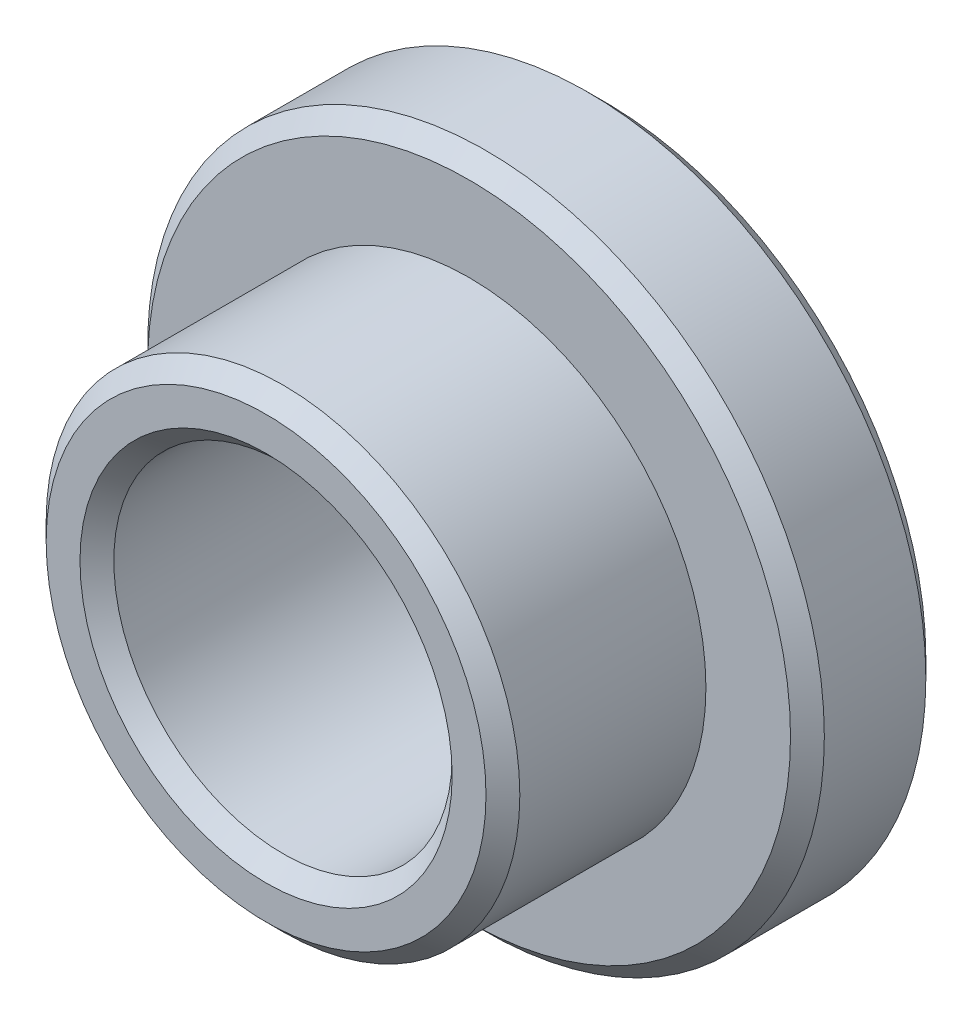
ISO-10303-21;
HEADER;
FILE_DESCRIPTION(('STEP AP214'),'2;1');
FILE_NAME('part.step','',(''),(''),'','','');
FILE_SCHEMA(('AUTOMOTIVE_DESIGN { 1 0 10303 214 1 1 1 1 }'));
ENDSEC;
DATA;
#1=APPLICATION_CONTEXT('core data for automotive mechanical design processes');
#2=APPLICATION_PROTOCOL_DEFINITION('international standard','automotive_design',2000,#1);
#3=PRODUCT_CONTEXT('',#1,'mechanical');
#4=PRODUCT('Part','Part','',(#3));
#5=PRODUCT_RELATED_PRODUCT_CATEGORY('part','',(#4));
#6=PRODUCT_DEFINITION_FORMATION('','',#4);
#7=PRODUCT_DEFINITION_CONTEXT('part definition',#1,'design');
#8=PRODUCT_DEFINITION('design','',#6,#7);
#9=PRODUCT_DEFINITION_SHAPE('','',#8);
#10=(LENGTH_UNIT() NAMED_UNIT(*) SI_UNIT(.MILLI.,.METRE.));
#11=(NAMED_UNIT(*) PLANE_ANGLE_UNIT() SI_UNIT($,.RADIAN.));
#12=(NAMED_UNIT(*) SI_UNIT($,.STERADIAN.) SOLID_ANGLE_UNIT());
#13=UNCERTAINTY_MEASURE_WITH_UNIT(LENGTH_MEASURE(1.E-05),#10,'distance_accuracy_value','');
#14=(GEOMETRIC_REPRESENTATION_CONTEXT(3) GLOBAL_UNCERTAINTY_ASSIGNED_CONTEXT((#13)) GLOBAL_UNIT_ASSIGNED_CONTEXT((#10,
#11,#12)) REPRESENTATION_CONTEXT('',''));
#15=CARTESIAN_POINT('',(0.,0.,0.));
#16=DIRECTION('',(0.,0.,1.));
#17=DIRECTION('',(1.,0.,0.));
#18=AXIS2_PLACEMENT_3D('',#15,#16,#17);
#19=CARTESIAN_POINT('',(0.,0.,2.));
#20=DIRECTION('',(0.,0.,-1.));
#21=DIRECTION('',(-1.,0.,0.));
#22=AXIS2_PLACEMENT_3D('',#19,#20,#21);
#23=CYLINDRICAL_SURFACE('',#22,5.);
#24=CARTESIAN_POINT('',(0.,0.,0.250000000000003));
#25=DIRECTION('',(0.,0.,1.));
#26=DIRECTION('',(1.,0.,0.));
#27=AXIS2_PLACEMENT_3D('',#24,#25,#26);
#28=CIRCLE('',#27,5.);
#29=CARTESIAN_POINT('',(5.,0.,0.250000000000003));
#30=VERTEX_POINT('',#29);
#31=EDGE_CURVE('E50',#30,#30,#28,.T.);
#32=ORIENTED_EDGE('',*,*,#31,.T.);
#33=EDGE_LOOP('',(#32));
#34=FACE_BOUND('',#33,.T.);
#35=CARTESIAN_POINT('',(0.,0.,1.75));
#36=DIRECTION('',(0.,0.,1.));
#37=DIRECTION('',(1.,0.,0.));
#38=AXIS2_PLACEMENT_3D('',#35,#36,#37);
#39=CIRCLE('',#38,5.);
#40=CARTESIAN_POINT('',(5.,0.,1.75));
#41=VERTEX_POINT('',#40);
#42=EDGE_CURVE('E53',#41,#41,#39,.F.);
#43=ORIENTED_EDGE('',*,*,#42,.T.);
#44=EDGE_LOOP('',(#43));
#45=FACE_BOUND('',#44,.T.);
#46=ADVANCED_FACE('F30',(#34,#45),#23,.T.);
#47=CARTESIAN_POINT('',(0.,0.,2.));
#48=DIRECTION('',(0.,0.,1.));
#49=DIRECTION('',(1.,0.,0.));
#50=AXIS2_PLACEMENT_3D('',#47,#48,#49);
#51=PLANE('',#50);
#52=CARTESIAN_POINT('',(0.,0.,2.));
#53=DIRECTION('',(0.,0.,1.));
#54=DIRECTION('',(1.,0.,0.));
#55=AXIS2_PLACEMENT_3D('',#52,#53,#54);
#56=CIRCLE('',#55,4.75);
#57=CARTESIAN_POINT('',(4.75,0.,2.));
#58=VERTEX_POINT('',#57);
#59=EDGE_CURVE('E45',#58,#58,#56,.T.);
#60=ORIENTED_EDGE('',*,*,#59,.T.);
#61=EDGE_LOOP('',(#60));
#62=FACE_BOUND('',#61,.T.);
#63=CARTESIAN_POINT('',(0.,0.,2.));
#64=DIRECTION('',(0.,0.,1.));
#65=DIRECTION('',(1.,0.,0.));
#66=AXIS2_PLACEMENT_3D('',#63,#64,#65);
#67=CIRCLE('',#66,3.5);
#68=CARTESIAN_POINT('',(3.5,0.,2.));
#69=VERTEX_POINT('',#68);
#70=EDGE_CURVE('E68',#69,#69,#67,.T.);
#71=ORIENTED_EDGE('',*,*,#70,.F.);
#72=EDGE_LOOP('',(#71));
#73=FACE_BOUND('',#72,.T.);
#74=ADVANCED_FACE('F74',(#62,#73),#51,.T.);
#75=CARTESIAN_POINT('',(0.,0.,0.));
#76=DIRECTION('',(0.,0.,1.));
#77=DIRECTION('',(1.,0.,0.));
#78=AXIS2_PLACEMENT_3D('',#75,#76,#77);
#79=PLANE('',#78);
#80=CARTESIAN_POINT('',(0.,0.,0.));
#81=DIRECTION('',(0.,0.,1.));
#82=DIRECTION('',(1.,0.,0.));
#83=AXIS2_PLACEMENT_3D('',#80,#81,#82);
#84=CIRCLE('',#83,2.75);
#85=CARTESIAN_POINT('',(2.75,0.,0.));
#86=VERTEX_POINT('',#85);
#87=EDGE_CURVE('E56',#86,#86,#84,.T.);
#88=ORIENTED_EDGE('',*,*,#87,.T.);
#89=EDGE_LOOP('',(#88));
#90=FACE_BOUND('',#89,.T.);
#91=CARTESIAN_POINT('',(0.,0.,0.));
#92=DIRECTION('',(0.,0.,1.));
#93=DIRECTION('',(1.,0.,0.));
#94=AXIS2_PLACEMENT_3D('',#91,#92,#93);
#95=CIRCLE('',#94,4.75);
#96=CARTESIAN_POINT('',(4.75,0.,0.));
#97=VERTEX_POINT('',#96);
#98=EDGE_CURVE('E59',#97,#97,#95,.F.);
#99=ORIENTED_EDGE('',*,*,#98,.T.);
#100=EDGE_LOOP('',(#99));
#101=FACE_BOUND('',#100,.T.);
#102=ADVANCED_FACE('F76',(#90,#101),#79,.F.);
#103=CARTESIAN_POINT('',(0.,0.,5.));
#104=DIRECTION('',(0.,0.,-1.));
#105=DIRECTION('',(-1.,0.,0.));
#106=AXIS2_PLACEMENT_3D('',#103,#104,#105);
#107=CYLINDRICAL_SURFACE('',#106,3.5);
#108=CARTESIAN_POINT('',(0.,0.,4.75));
#109=DIRECTION('',(0.,0.,1.));
#110=DIRECTION('',(1.,0.,0.));
#111=AXIS2_PLACEMENT_3D('',#108,#109,#110);
#112=CIRCLE('',#111,3.5);
#113=CARTESIAN_POINT('',(3.5,0.,4.75));
#114=VERTEX_POINT('',#113);
#115=EDGE_CURVE('E10',#114,#114,#112,.F.);
#116=ORIENTED_EDGE('',*,*,#115,.T.);
#117=EDGE_LOOP('',(#116));
#118=FACE_BOUND('',#117,.T.);
#119=ORIENTED_EDGE('',*,*,#70,.T.);
#120=EDGE_LOOP('',(#119));
#121=FACE_BOUND('',#120,.T.);
#122=ADVANCED_FACE('F72',(#118,#121),#107,.T.);
#123=CARTESIAN_POINT('',(0.,0.,5.));
#124=DIRECTION('',(0.,0.,1.));
#125=DIRECTION('',(1.,0.,0.));
#126=AXIS2_PLACEMENT_3D('',#123,#124,#125);
#127=PLANE('',#126);
#128=CARTESIAN_POINT('',(0.,0.,5.));
#129=DIRECTION('',(0.,0.,1.));
#130=DIRECTION('',(1.,0.,0.));
#131=AXIS2_PLACEMENT_3D('',#128,#129,#130);
#132=CIRCLE('',#131,2.75);
#133=CARTESIAN_POINT('',(2.75,0.,5.));
#134=VERTEX_POINT('',#133);
#135=EDGE_CURVE('E37',#134,#134,#132,.F.);
#136=ORIENTED_EDGE('',*,*,#135,.T.);
#137=EDGE_LOOP('',(#136));
#138=FACE_BOUND('',#137,.T.);
#139=CARTESIAN_POINT('',(0.,0.,5.));
#140=DIRECTION('',(0.,0.,1.));
#141=DIRECTION('',(1.,0.,0.));
#142=AXIS2_PLACEMENT_3D('',#139,#140,#141);
#143=CIRCLE('',#142,3.25);
#144=CARTESIAN_POINT('',(3.25,0.,5.));
#145=VERTEX_POINT('',#144);
#146=EDGE_CURVE('E41',#145,#145,#143,.T.);
#147=ORIENTED_EDGE('',*,*,#146,.T.);
#148=EDGE_LOOP('',(#147));
#149=FACE_BOUND('',#148,.T.);
#150=ADVANCED_FACE('F113',(#138,#149),#127,.T.);
#151=CARTESIAN_POINT('',(0.,0.,-0.00100000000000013));
#152=DIRECTION('',(0.,0.,1.));
#153=DIRECTION('',(1.,0.,0.));
#154=AXIS2_PLACEMENT_3D('',#151,#152,#153);
#155=CYLINDRICAL_SURFACE('',#154,2.5);
#156=CARTESIAN_POINT('',(0.,0.,0.250000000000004));
#157=DIRECTION('',(0.,0.,1.));
#158=DIRECTION('',(1.,0.,0.));
#159=AXIS2_PLACEMENT_3D('',#156,#157,#158);
#160=CIRCLE('',#159,2.5);
#161=CARTESIAN_POINT('',(2.5,0.,0.250000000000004));
#162=VERTEX_POINT('',#161);
#163=EDGE_CURVE('E62',#162,#162,#160,.F.);
#164=ORIENTED_EDGE('',*,*,#163,.T.);
#165=EDGE_LOOP('',(#164));
#166=FACE_BOUND('',#165,.T.);
#167=CARTESIAN_POINT('',(0.,0.,4.75));
#168=DIRECTION('',(0.,0.,1.));
#169=DIRECTION('',(1.,0.,0.));
#170=AXIS2_PLACEMENT_3D('',#167,#168,#169);
#171=CIRCLE('',#170,2.5);
#172=CARTESIAN_POINT('',(2.5,0.,4.75));
#173=VERTEX_POINT('',#172);
#174=EDGE_CURVE('E65',#173,#173,#171,.T.);
#175=ORIENTED_EDGE('',*,*,#174,.T.);
#176=EDGE_LOOP('',(#175));
#177=FACE_BOUND('',#176,.T.);
#178=ADVANCED_FACE('F94',(#166,#177),#155,.F.);
#179=CARTESIAN_POINT('',(0.,0.,0.250000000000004));
#180=DIRECTION('',(0.,0.,-1.));
#181=DIRECTION('',(-1.,0.,0.));
#182=AXIS2_PLACEMENT_3D('',#179,#180,#181);
#183=CONICAL_SURFACE('',#182,2.5,0.785398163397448);
#184=ORIENTED_EDGE('',*,*,#87,.F.);
#185=EDGE_LOOP('',(#184));
#186=FACE_BOUND('',#185,.T.);
#187=ORIENTED_EDGE('',*,*,#163,.F.);
#188=EDGE_LOOP('',(#187));
#189=FACE_BOUND('',#188,.T.);
#190=ADVANCED_FACE('F90',(#186,#189),#183,.F.);
#191=CARTESIAN_POINT('',(0.,0.,0.250000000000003));
#192=DIRECTION('',(0.,0.,1.));
#193=DIRECTION('',(1.,0.,0.));
#194=AXIS2_PLACEMENT_3D('',#191,#192,#193);
#195=CONICAL_SURFACE('',#194,5.,0.78539816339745);
#196=ORIENTED_EDGE('',*,*,#98,.F.);
#197=EDGE_LOOP('',(#196));
#198=FACE_BOUND('',#197,.T.);
#199=ORIENTED_EDGE('',*,*,#31,.F.);
#200=EDGE_LOOP('',(#199));
#201=FACE_BOUND('',#200,.T.);
#202=ADVANCED_FACE('F93',(#198,#201),#195,.T.);
#203=CARTESIAN_POINT('',(0.,0.,2.));
#204=DIRECTION('',(0.,0.,-1.));
#205=DIRECTION('',(-1.,0.,0.));
#206=AXIS2_PLACEMENT_3D('',#203,#204,#205);
#207=CONICAL_SURFACE('',#206,4.75,0.785398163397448);
#208=ORIENTED_EDGE('',*,*,#42,.F.);
#209=EDGE_LOOP('',(#208));
#210=FACE_BOUND('',#209,.T.);
#211=ORIENTED_EDGE('',*,*,#59,.F.);
#212=EDGE_LOOP('',(#211));
#213=FACE_BOUND('',#212,.T.);
#214=ADVANCED_FACE('F98',(#210,#213),#207,.T.);
#215=CARTESIAN_POINT('',(0.,0.,4.75));
#216=DIRECTION('',(0.,0.,1.));
#217=DIRECTION('',(1.,0.,0.));
#218=AXIS2_PLACEMENT_3D('',#215,#216,#217);
#219=CONICAL_SURFACE('',#218,2.5,0.785398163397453);
#220=ORIENTED_EDGE('',*,*,#135,.F.);
#221=EDGE_LOOP('',(#220));
#222=FACE_BOUND('',#221,.T.);
#223=ORIENTED_EDGE('',*,*,#174,.F.);
#224=EDGE_LOOP('',(#223));
#225=FACE_BOUND('',#224,.T.);
#226=ADVANCED_FACE('F101',(#222,#225),#219,.F.);
#227=CARTESIAN_POINT('',(0.,0.,5.));
#228=DIRECTION('',(0.,0.,-1.));
#229=DIRECTION('',(-1.,0.,0.));
#230=AXIS2_PLACEMENT_3D('',#227,#228,#229);
#231=CONICAL_SURFACE('',#230,3.25,0.785398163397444);
#232=ORIENTED_EDGE('',*,*,#115,.F.);
#233=EDGE_LOOP('',(#232));
#234=FACE_BOUND('',#233,.T.);
#235=ORIENTED_EDGE('',*,*,#146,.F.);
#236=EDGE_LOOP('',(#235));
#237=FACE_BOUND('',#236,.T.);
#238=ADVANCED_FACE('F32',(#234,#237),#231,.T.);
#239=CLOSED_SHELL('',(#46,#74,#102,#122,#150,#178,#190,#202,#214,#226,#238));
#240=MANIFOLD_SOLID_BREP('B2',#239);
#241=ADVANCED_BREP_SHAPE_REPRESENTATION('',(#18,#240),#14);
#242=SHAPE_DEFINITION_REPRESENTATION(#9,#241);
ENDSEC;
END-ISO-10303-21;
